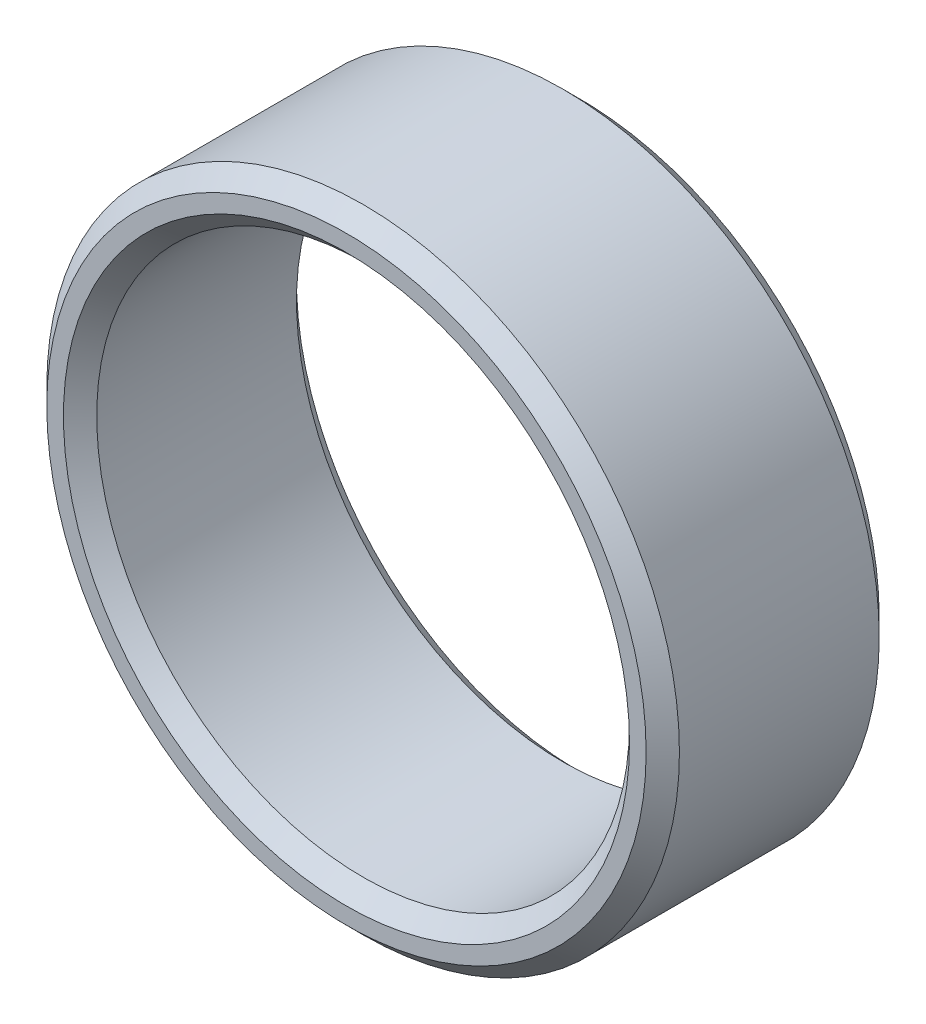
ISO-10303-21;
HEADER;
FILE_DESCRIPTION(('STEP AP214'),'2;1');
FILE_NAME('part.step','',(''),(''),'','','');
FILE_SCHEMA(('AUTOMOTIVE_DESIGN { 1 0 10303 214 1 1 1 1 }'));
ENDSEC;
DATA;
#1=APPLICATION_CONTEXT('core data for automotive mechanical design processes');
#2=APPLICATION_PROTOCOL_DEFINITION('international standard','automotive_design',2000,#1);
#3=PRODUCT_CONTEXT('',#1,'mechanical');
#4=PRODUCT('Part','Part','',(#3));
#5=PRODUCT_RELATED_PRODUCT_CATEGORY('part','',(#4));
#6=PRODUCT_DEFINITION_FORMATION('','',#4);
#7=PRODUCT_DEFINITION_CONTEXT('part definition',#1,'design');
#8=PRODUCT_DEFINITION('design','',#6,#7);
#9=PRODUCT_DEFINITION_SHAPE('','',#8);
#10=(LENGTH_UNIT() NAMED_UNIT(*) SI_UNIT(.MILLI.,.METRE.));
#11=(NAMED_UNIT(*) PLANE_ANGLE_UNIT() SI_UNIT($,.RADIAN.));
#12=(NAMED_UNIT(*) SI_UNIT($,.STERADIAN.) SOLID_ANGLE_UNIT());
#13=UNCERTAINTY_MEASURE_WITH_UNIT(LENGTH_MEASURE(1.E-05),#10,'distance_accuracy_value','');
#14=(GEOMETRIC_REPRESENTATION_CONTEXT(3) GLOBAL_UNCERTAINTY_ASSIGNED_CONTEXT((#13)) GLOBAL_UNIT_ASSIGNED_CONTEXT((#10,
#11,#12)) REPRESENTATION_CONTEXT('',''));
#15=CARTESIAN_POINT('',(0.,0.,0.));
#16=DIRECTION('',(0.,0.,1.));
#17=DIRECTION('',(1.,0.,0.));
#18=AXIS2_PLACEMENT_3D('',#15,#16,#17);
#19=CARTESIAN_POINT('',(0.,0.,7.));
#20=DIRECTION('',(0.,0.,1.));
#21=DIRECTION('',(1.,0.,0.));
#22=AXIS2_PLACEMENT_3D('',#19,#20,#21);
#23=PLANE('',#22);
#24=CARTESIAN_POINT('',(0.,0.,7.));
#25=DIRECTION('',(0.,0.,1.));
#26=DIRECTION('',(1.,0.,0.));
#27=AXIS2_PLACEMENT_3D('',#24,#25,#26);
#28=CIRCLE('',#27,8.5);
#29=CARTESIAN_POINT('',(8.5,0.,7.));
#30=VERTEX_POINT('',#29);
#31=EDGE_CURVE('E19',#30,#30,#28,.F.);
#32=ORIENTED_EDGE('',*,*,#31,.T.);
#33=EDGE_LOOP('',(#32));
#34=FACE_BOUND('',#33,.T.);
#35=CARTESIAN_POINT('',(0.,0.,7.));
#36=DIRECTION('',(0.,0.,1.));
#37=DIRECTION('',(1.,0.,0.));
#38=AXIS2_PLACEMENT_3D('',#35,#36,#37);
#39=CIRCLE('',#38,9.);
#40=CARTESIAN_POINT('',(9.,0.,7.));
#41=VERTEX_POINT('',#40);
#42=EDGE_CURVE('E32',#41,#41,#39,.T.);
#43=ORIENTED_EDGE('',*,*,#42,.T.);
#44=EDGE_LOOP('',(#43));
#45=FACE_BOUND('',#44,.T.);
#46=ADVANCED_FACE('F12',(#34,#45),#23,.T.);
#47=CARTESIAN_POINT('',(0.,0.,0.));
#48=DIRECTION('',(0.,0.,1.));
#49=DIRECTION('',(1.,0.,0.));
#50=AXIS2_PLACEMENT_3D('',#47,#48,#49);
#51=PLANE('',#50);
#52=CARTESIAN_POINT('',(0.,0.,0.));
#53=DIRECTION('',(0.,0.,1.));
#54=DIRECTION('',(1.,0.,0.));
#55=AXIS2_PLACEMENT_3D('',#52,#53,#54);
#56=CIRCLE('',#55,8.5);
#57=CARTESIAN_POINT('',(8.5,0.,0.));
#58=VERTEX_POINT('',#57);
#59=EDGE_CURVE('E8',#58,#58,#56,.T.);
#60=ORIENTED_EDGE('',*,*,#59,.T.);
#61=EDGE_LOOP('',(#60));
#62=FACE_BOUND('',#61,.T.);
#63=CARTESIAN_POINT('',(0.,0.,0.));
#64=DIRECTION('',(0.,0.,1.));
#65=DIRECTION('',(1.,0.,0.));
#66=AXIS2_PLACEMENT_3D('',#63,#64,#65);
#67=CIRCLE('',#66,9.);
#68=CARTESIAN_POINT('',(9.,0.,0.));
#69=VERTEX_POINT('',#68);
#70=EDGE_CURVE('E35',#69,#69,#67,.F.);
#71=ORIENTED_EDGE('',*,*,#70,.T.);
#72=EDGE_LOOP('',(#71));
#73=FACE_BOUND('',#72,.T.);
#74=ADVANCED_FACE('F56',(#62,#73),#51,.F.);
#75=CARTESIAN_POINT('',(0.,0.,7.));
#76=DIRECTION('',(0.,0.,-1.));
#77=DIRECTION('',(-1.,0.,0.));
#78=AXIS2_PLACEMENT_3D('',#75,#76,#77);
#79=CYLINDRICAL_SURFACE('',#78,9.5);
#80=CARTESIAN_POINT('',(0.,0.,0.500000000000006));
#81=DIRECTION('',(0.,0.,1.));
#82=DIRECTION('',(1.,0.,0.));
#83=AXIS2_PLACEMENT_3D('',#80,#81,#82);
#84=CIRCLE('',#83,9.5);
#85=CARTESIAN_POINT('',(9.5,0.,0.500000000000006));
#86=VERTEX_POINT('',#85);
#87=EDGE_CURVE('E38',#86,#86,#84,.T.);
#88=ORIENTED_EDGE('',*,*,#87,.T.);
#89=EDGE_LOOP('',(#88));
#90=FACE_BOUND('',#89,.T.);
#91=CARTESIAN_POINT('',(0.,0.,6.5));
#92=DIRECTION('',(0.,0.,1.));
#93=DIRECTION('',(1.,0.,0.));
#94=AXIS2_PLACEMENT_3D('',#91,#92,#93);
#95=CIRCLE('',#94,9.5);
#96=CARTESIAN_POINT('',(9.5,0.,6.5));
#97=VERTEX_POINT('',#96);
#98=EDGE_CURVE('E41',#97,#97,#95,.F.);
#99=ORIENTED_EDGE('',*,*,#98,.T.);
#100=EDGE_LOOP('',(#99));
#101=FACE_BOUND('',#100,.T.);
#102=ADVANCED_FACE('F45',(#90,#101),#79,.T.);
#103=CARTESIAN_POINT('',(0.,0.,7.));
#104=DIRECTION('',(0.,0.,-1.));
#105=DIRECTION('',(-1.,0.,0.));
#106=AXIS2_PLACEMENT_3D('',#103,#104,#105);
#107=CYLINDRICAL_SURFACE('',#106,8.);
#108=CARTESIAN_POINT('',(0.,0.,6.5));
#109=DIRECTION('',(0.,0.,1.));
#110=DIRECTION('',(1.,0.,0.));
#111=AXIS2_PLACEMENT_3D('',#108,#109,#110);
#112=CIRCLE('',#111,8.);
#113=CARTESIAN_POINT('',(8.,0.,6.5));
#114=VERTEX_POINT('',#113);
#115=EDGE_CURVE('E23',#114,#114,#112,.T.);
#116=ORIENTED_EDGE('',*,*,#115,.T.);
#117=EDGE_LOOP('',(#116));
#118=FACE_BOUND('',#117,.T.);
#119=CARTESIAN_POINT('',(0.,0.,0.500000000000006));
#120=DIRECTION('',(0.,0.,1.));
#121=DIRECTION('',(1.,0.,0.));
#122=AXIS2_PLACEMENT_3D('',#119,#120,#121);
#123=CIRCLE('',#122,8.);
#124=CARTESIAN_POINT('',(8.,0.,0.500000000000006));
#125=VERTEX_POINT('',#124);
#126=EDGE_CURVE('E27',#125,#125,#123,.F.);
#127=ORIENTED_EDGE('',*,*,#126,.T.);
#128=EDGE_LOOP('',(#127));
#129=FACE_BOUND('',#128,.T.);
#130=ADVANCED_FACE('F64',(#118,#129),#107,.F.);
#131=CARTESIAN_POINT('',(0.,0.,0.500000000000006));
#132=DIRECTION('',(0.,0.,1.));
#133=DIRECTION('',(1.,0.,0.));
#134=AXIS2_PLACEMENT_3D('',#131,#132,#133);
#135=CONICAL_SURFACE('',#134,9.5,0.785398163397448);
#136=ORIENTED_EDGE('',*,*,#70,.F.);
#137=EDGE_LOOP('',(#136));
#138=FACE_BOUND('',#137,.T.);
#139=ORIENTED_EDGE('',*,*,#87,.F.);
#140=EDGE_LOOP('',(#139));
#141=FACE_BOUND('',#140,.T.);
#142=ADVANCED_FACE('F51',(#138,#141),#135,.T.);
#143=CARTESIAN_POINT('',(0.,0.,7.));
#144=DIRECTION('',(0.,0.,-1.));
#145=DIRECTION('',(-1.,0.,0.));
#146=AXIS2_PLACEMENT_3D('',#143,#144,#145);
#147=CONICAL_SURFACE('',#146,9.,0.785398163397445);
#148=ORIENTED_EDGE('',*,*,#98,.F.);
#149=EDGE_LOOP('',(#148));
#150=FACE_BOUND('',#149,.T.);
#151=ORIENTED_EDGE('',*,*,#42,.F.);
#152=EDGE_LOOP('',(#151));
#153=FACE_BOUND('',#152,.T.);
#154=ADVANCED_FACE('F47',(#150,#153),#147,.T.);
#155=CARTESIAN_POINT('',(0.,0.,6.5));
#156=DIRECTION('',(0.,0.,1.));
#157=DIRECTION('',(1.,0.,0.));
#158=AXIS2_PLACEMENT_3D('',#155,#156,#157);
#159=CONICAL_SURFACE('',#158,8.,0.785398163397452);
#160=ORIENTED_EDGE('',*,*,#31,.F.);
#161=EDGE_LOOP('',(#160));
#162=FACE_BOUND('',#161,.T.);
#163=ORIENTED_EDGE('',*,*,#115,.F.);
#164=EDGE_LOOP('',(#163));
#165=FACE_BOUND('',#164,.T.);
#166=ADVANCED_FACE('F50',(#162,#165),#159,.F.);
#167=CARTESIAN_POINT('',(0.,0.,0.));
#168=DIRECTION('',(0.,0.,-1.));
#169=DIRECTION('',(-1.,0.,0.));
#170=AXIS2_PLACEMENT_3D('',#167,#168,#169);
#171=CONICAL_SURFACE('',#170,8.5,0.785398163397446);
#172=ORIENTED_EDGE('',*,*,#126,.F.);
#173=EDGE_LOOP('',(#172));
#174=FACE_BOUND('',#173,.T.);
#175=ORIENTED_EDGE('',*,*,#59,.F.);
#176=EDGE_LOOP('',(#175));
#177=FACE_BOUND('',#176,.T.);
#178=ADVANCED_FACE('F14',(#174,#177),#171,.F.);
#179=CLOSED_SHELL('',(#46,#74,#102,#130,#142,#154,#166,#178));
#180=MANIFOLD_SOLID_BREP('B1',#179);
#181=ADVANCED_BREP_SHAPE_REPRESENTATION('',(#18,#180),#14);
#182=SHAPE_DEFINITION_REPRESENTATION(#9,#181);
ENDSEC;
END-ISO-10303-21;
